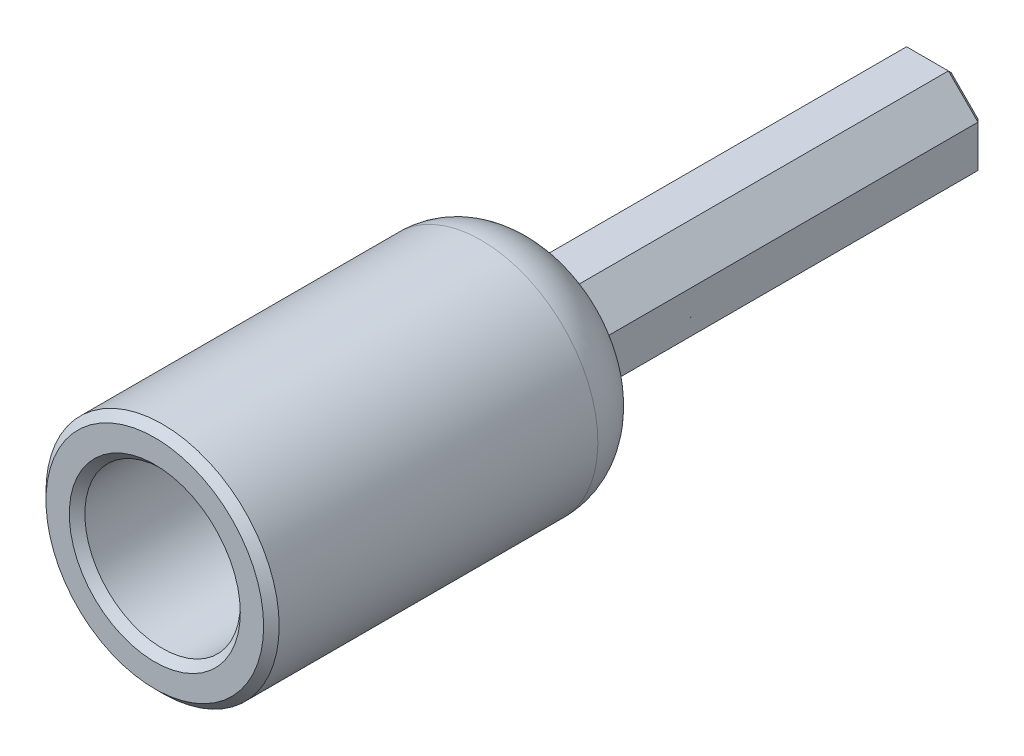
ISO-10303-21;
HEADER;
FILE_DESCRIPTION(('STEP AP214'),'2;1');
FILE_NAME('part.step','',(''),(''),'','','');
FILE_SCHEMA(('AUTOMOTIVE_DESIGN { 1 0 10303 214 1 1 1 1 }'));
ENDSEC;
DATA;
#1=APPLICATION_CONTEXT('core data for automotive mechanical design processes');
#2=APPLICATION_PROTOCOL_DEFINITION('international standard','automotive_design',2000,#1);
#3=PRODUCT_CONTEXT('',#1,'mechanical');
#4=PRODUCT('Part','Part','',(#3));
#5=PRODUCT_RELATED_PRODUCT_CATEGORY('part','',(#4));
#6=PRODUCT_DEFINITION_FORMATION('','',#4);
#7=PRODUCT_DEFINITION_CONTEXT('part definition',#1,'design');
#8=PRODUCT_DEFINITION('design','',#6,#7);
#9=PRODUCT_DEFINITION_SHAPE('','',#8);
#10=(LENGTH_UNIT() NAMED_UNIT(*) SI_UNIT(.MILLI.,.METRE.));
#11=(NAMED_UNIT(*) PLANE_ANGLE_UNIT() SI_UNIT($,.RADIAN.));
#12=(NAMED_UNIT(*) SI_UNIT($,.STERADIAN.) SOLID_ANGLE_UNIT());
#13=UNCERTAINTY_MEASURE_WITH_UNIT(LENGTH_MEASURE(1.E-05),#10,'distance_accuracy_value','');
#14=(GEOMETRIC_REPRESENTATION_CONTEXT(3) GLOBAL_UNCERTAINTY_ASSIGNED_CONTEXT((#13)) GLOBAL_UNIT_ASSIGNED_CONTEXT((#10,
#11,#12)) REPRESENTATION_CONTEXT('',''));
#15=CARTESIAN_POINT('',(0.,0.,0.));
#16=DIRECTION('',(0.,0.,1.));
#17=DIRECTION('',(1.,0.,0.));
#18=AXIS2_PLACEMENT_3D('',#15,#16,#17);
#19=CARTESIAN_POINT('',(0.,0.,0.));
#20=DIRECTION('',(0.,0.,1.));
#21=DIRECTION('',(1.,0.,0.));
#22=AXIS2_PLACEMENT_3D('',#19,#20,#21);
#23=PLANE('',#22);
#24=DIRECTION('',(1.,0.,0.));
#25=VECTOR('',#24,1.);
#26=CARTESIAN_POINT('',(-1.34619407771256,3.25,0.));
#27=LINE('',#26,#25);
#28=CARTESIAN_POINT('',(-1.29903810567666,3.25,0.));
#29=VERTEX_POINT('',#28);
#30=CARTESIAN_POINT('',(1.29903810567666,3.25,0.));
#31=VERTEX_POINT('',#30);
#32=EDGE_CURVE('E351',#29,#31,#27,.T.);
#33=ORIENTED_EDGE('',*,*,#32,.F.);
#34=CARTESIAN_POINT('',(0.,0.,0.));
#35=DIRECTION('',(0.,0.,1.));
#36=DIRECTION('',(1.,0.,0.));
#37=AXIS2_PLACEMENT_3D('',#34,#35,#36);
#38=CIRCLE('',#37,3.5);
#39=EDGE_CURVE('E226',#29,#31,#38,.F.);
#40=ORIENTED_EDGE('',*,*,#39,.T.);
#41=EDGE_LOOP('',(#33,#40));
#42=FACE_BOUND('',#41,.T.);
#43=ADVANCED_FACE('F33',(#42),#23,.F.);
#44=DIRECTION('',(0.707106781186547,-0.707106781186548,0.));
#45=VECTOR('',#44,1.);
#46=CARTESIAN_POINT('',(1.34619407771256,3.25,0.));
#47=LINE('',#46,#45);
#48=CARTESIAN_POINT('',(1.37953838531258,3.21665569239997,0.));
#49=VERTEX_POINT('',#48);
#50=CARTESIAN_POINT('',(3.21665569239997,1.37953838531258,0.));
#51=VERTEX_POINT('',#50);
#52=EDGE_CURVE('E344',#49,#51,#47,.T.);
#53=ORIENTED_EDGE('',*,*,#52,.F.);
#54=CARTESIAN_POINT('',(0.,0.,0.));
#55=DIRECTION('',(0.,0.,1.));
#56=DIRECTION('',(1.,0.,0.));
#57=AXIS2_PLACEMENT_3D('',#54,#55,#56);
#58=CIRCLE('',#57,3.5);
#59=EDGE_CURVE('E224',#49,#51,#58,.F.);
#60=ORIENTED_EDGE('',*,*,#59,.T.);
#61=EDGE_LOOP('',(#53,#60));
#62=FACE_BOUND('',#61,.T.);
#63=ADVANCED_FACE('F349',(#62),#23,.F.);
#64=DIRECTION('',(0.,-1.,0.));
#65=VECTOR('',#64,1.);
#66=CARTESIAN_POINT('',(3.25,1.34619407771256,0.));
#67=LINE('',#66,#65);
#68=CARTESIAN_POINT('',(3.25,1.29903810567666,0.));
#69=VERTEX_POINT('',#68);
#70=CARTESIAN_POINT('',(3.25,-1.29903810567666,0.));
#71=VERTEX_POINT('',#70);
#72=EDGE_CURVE('E350',#69,#71,#67,.T.);
#73=ORIENTED_EDGE('',*,*,#72,.F.);
#74=CARTESIAN_POINT('',(0.,0.,0.));
#75=DIRECTION('',(0.,0.,1.));
#76=DIRECTION('',(1.,0.,0.));
#77=AXIS2_PLACEMENT_3D('',#74,#75,#76);
#78=CIRCLE('',#77,3.5);
#79=EDGE_CURVE('E217',#69,#71,#78,.F.);
#80=ORIENTED_EDGE('',*,*,#79,.T.);
#81=EDGE_LOOP('',(#73,#80));
#82=FACE_BOUND('',#81,.T.);
#83=ADVANCED_FACE('F361',(#82),#23,.F.);
#84=DIRECTION('',(-0.707106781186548,-0.707106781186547,0.));
#85=VECTOR('',#84,1.);
#86=CARTESIAN_POINT('',(3.25,-1.34619407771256,0.));
#87=LINE('',#86,#85);
#88=CARTESIAN_POINT('',(3.21665569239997,-1.37953838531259,0.));
#89=VERTEX_POINT('',#88);
#90=CARTESIAN_POINT('',(1.37953838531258,-3.21665569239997,0.));
#91=VERTEX_POINT('',#90);
#92=EDGE_CURVE('E362',#89,#91,#87,.T.);
#93=ORIENTED_EDGE('',*,*,#92,.F.);
#94=CARTESIAN_POINT('',(0.,0.,0.));
#95=DIRECTION('',(0.,0.,1.));
#96=DIRECTION('',(1.,0.,0.));
#97=AXIS2_PLACEMENT_3D('',#94,#95,#96);
#98=CIRCLE('',#97,3.5);
#99=EDGE_CURVE('E213',#89,#91,#98,.F.);
#100=ORIENTED_EDGE('',*,*,#99,.T.);
#101=EDGE_LOOP('',(#93,#100));
#102=FACE_BOUND('',#101,.T.);
#103=ADVANCED_FACE('F504',(#102),#23,.F.);
#104=DIRECTION('',(-0.707106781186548,0.707106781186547,0.));
#105=VECTOR('',#104,1.);
#106=CARTESIAN_POINT('',(-1.34619407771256,-3.25,0.));
#107=LINE('',#106,#105);
#108=CARTESIAN_POINT('',(-1.37953838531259,-3.21665569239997,0.));
#109=VERTEX_POINT('',#108);
#110=CARTESIAN_POINT('',(-3.21665569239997,-1.37953838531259,0.));
#111=VERTEX_POINT('',#110);
#112=EDGE_CURVE('E200',#109,#111,#107,.T.);
#113=ORIENTED_EDGE('',*,*,#112,.F.);
#114=CARTESIAN_POINT('',(0.,0.,0.));
#115=DIRECTION('',(0.,0.,1.));
#116=DIRECTION('',(1.,0.,0.));
#117=AXIS2_PLACEMENT_3D('',#114,#115,#116);
#118=CIRCLE('',#117,3.5);
#119=EDGE_CURVE('E207',#109,#111,#118,.F.);
#120=ORIENTED_EDGE('',*,*,#119,.T.);
#121=EDGE_LOOP('',(#113,#120));
#122=FACE_BOUND('',#121,.T.);
#123=ADVANCED_FACE('F206',(#122),#23,.F.);
#124=DIRECTION('',(0.,1.,0.));
#125=VECTOR('',#124,1.);
#126=CARTESIAN_POINT('',(-3.25,-1.34619407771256,0.));
#127=LINE('',#126,#125);
#128=CARTESIAN_POINT('',(-3.25,-1.29903810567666,0.));
#129=VERTEX_POINT('',#128);
#130=CARTESIAN_POINT('',(-3.25,1.29903810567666,0.));
#131=VERTEX_POINT('',#130);
#132=EDGE_CURVE('E208',#129,#131,#127,.T.);
#133=ORIENTED_EDGE('',*,*,#132,.F.);
#134=CARTESIAN_POINT('',(0.,0.,0.));
#135=DIRECTION('',(0.,0.,1.));
#136=DIRECTION('',(1.,0.,0.));
#137=AXIS2_PLACEMENT_3D('',#134,#135,#136);
#138=CIRCLE('',#137,3.5);
#139=EDGE_CURVE('E214',#129,#131,#138,.F.);
#140=ORIENTED_EDGE('',*,*,#139,.T.);
#141=EDGE_LOOP('',(#133,#140));
#142=FACE_BOUND('',#141,.T.);
#143=ADVANCED_FACE('F511',(#142),#23,.F.);
#144=CARTESIAN_POINT('',(0.,0.,25.));
#145=DIRECTION('',(0.,0.,-1.));
#146=DIRECTION('',(-1.,0.,0.));
#147=AXIS2_PLACEMENT_3D('',#144,#145,#146);
#148=CYLINDRICAL_SURFACE('',#147,2.5);
#149=CARTESIAN_POINT('',(0.,0.,-25.));
#150=DIRECTION('',(0.,0.,-1.));
#151=DIRECTION('',(-1.,0.,0.));
#152=AXIS2_PLACEMENT_3D('',#149,#150,#151);
#153=CIRCLE('',#152,2.5);
#154=CARTESIAN_POINT('',(-2.5,0.,-25.));
#155=VERTEX_POINT('',#154);
#156=EDGE_CURVE('E387',#155,#155,#153,.T.);
#157=ORIENTED_EDGE('',*,*,#156,.T.);
#158=EDGE_LOOP('',(#157));
#159=FACE_BOUND('',#158,.T.);
#160=CARTESIAN_POINT('',(0.,0.,13.));
#161=DIRECTION('',(0.,0.,1.));
#162=DIRECTION('',(1.,0.,0.));
#163=AXIS2_PLACEMENT_3D('',#160,#161,#162);
#164=CIRCLE('',#163,2.5);
#165=CARTESIAN_POINT('',(2.5,0.,13.));
#166=VERTEX_POINT('',#165);
#167=EDGE_CURVE('E384',#166,#166,#164,.F.);
#168=ORIENTED_EDGE('',*,*,#167,.F.);
#169=EDGE_LOOP('',(#168));
#170=FACE_BOUND('',#169,.T.);
#171=ADVANCED_FACE('F519',(#159,#170),#148,.F.);
#172=DIRECTION('',(0.707106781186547,0.707106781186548,0.));
#173=VECTOR('',#172,1.);
#174=CARTESIAN_POINT('',(-3.25,1.34619407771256,0.));
#175=LINE('',#174,#173);
#176=CARTESIAN_POINT('',(-3.21665569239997,1.37953838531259,0.));
#177=VERTEX_POINT('',#176);
#178=CARTESIAN_POINT('',(-1.37953838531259,3.21665569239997,0.));
#179=VERTEX_POINT('',#178);
#180=EDGE_CURVE('E461',#177,#179,#175,.T.);
#181=ORIENTED_EDGE('',*,*,#180,.F.);
#182=CARTESIAN_POINT('',(0.,0.,0.));
#183=DIRECTION('',(0.,0.,1.));
#184=DIRECTION('',(1.,0.,0.));
#185=AXIS2_PLACEMENT_3D('',#182,#183,#184);
#186=CIRCLE('',#185,3.5);
#187=EDGE_CURVE('E219',#177,#179,#186,.F.);
#188=ORIENTED_EDGE('',*,*,#187,.T.);
#189=EDGE_LOOP('',(#181,#188));
#190=FACE_BOUND('',#189,.T.);
#191=ADVANCED_FACE('F460',(#190),#23,.F.);
#192=CARTESIAN_POINT('',(0.,0.,25.));
#193=DIRECTION('',(0.,0.,-1.));
#194=DIRECTION('',(-1.,0.,0.));
#195=AXIS2_PLACEMENT_3D('',#192,#193,#194);
#196=CYLINDRICAL_SURFACE('',#195,7.5);
#197=CARTESIAN_POINT('',(0.,0.,4.));
#198=DIRECTION('',(0.,0.,1.));
#199=DIRECTION('',(1.,0.,0.));
#200=AXIS2_PLACEMENT_3D('',#197,#198,#199);
#201=CIRCLE('',#200,7.5);
#202=CARTESIAN_POINT('',(2.09601180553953,-7.20116202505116,4.));
#203=VERTEX_POINT('',#202);
#204=CARTESIAN_POINT('',(-2.09601180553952,-7.20116202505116,4.));
#205=VERTEX_POINT('',#204);
#206=EDGE_CURVE('E433',#203,#205,#201,.T.);
#207=ORIENTED_EDGE('',*,*,#206,.T.);
#208=CARTESIAN_POINT('',(0.,0.,-3.22916358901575));
#209=DIRECTION('',(0.,0.708477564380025,0.705733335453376));
#210=DIRECTION('',(0.,0.705733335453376,-0.708477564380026));
#211=AXIS2_PLACEMENT_3D('',#208,#209,#210);
#212=ELLIPSE('',#211,10.627243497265,7.5);
#213=EDGE_CURVE('E180',#205,#203,#212,.T.);
#214=ORIENTED_EDGE('',*,*,#213,.T.);
#215=EDGE_LOOP('',(#207,#214));
#216=FACE_BOUND('',#215,.T.);
#217=CARTESIAN_POINT('',(0.,0.,24.5));
#218=DIRECTION('',(0.,0.,1.));
#219=DIRECTION('',(1.,0.,0.));
#220=AXIS2_PLACEMENT_3D('',#217,#218,#219);
#221=CIRCLE('',#220,7.5);
#222=CARTESIAN_POINT('',(7.5,0.,24.5));
#223=VERTEX_POINT('',#222);
#224=EDGE_CURVE('E397',#223,#223,#221,.F.);
#225=ORIENTED_EDGE('',*,*,#224,.T.);
#226=EDGE_LOOP('',(#225));
#227=FACE_BOUND('',#226,.T.);
#228=ADVANCED_FACE('F518',(#216,#227),#196,.T.);
#229=CARTESIAN_POINT('',(0.,0.,25.));
#230=DIRECTION('',(0.,0.,1.));
#231=DIRECTION('',(1.,0.,0.));
#232=AXIS2_PLACEMENT_3D('',#229,#230,#231);
#233=PLANE('',#232);
#234=CARTESIAN_POINT('',(0.,0.,25.));
#235=DIRECTION('',(0.,0.,1.));
#236=DIRECTION('',(1.,0.,0.));
#237=AXIS2_PLACEMENT_3D('',#234,#235,#236);
#238=CIRCLE('',#237,5.50000000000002);
#239=CARTESIAN_POINT('',(5.50000000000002,0.,25.));
#240=VERTEX_POINT('',#239);
#241=EDGE_CURVE('E394',#240,#240,#238,.F.);
#242=ORIENTED_EDGE('',*,*,#241,.T.);
#243=EDGE_LOOP('',(#242));
#244=FACE_BOUND('',#243,.T.);
#245=CARTESIAN_POINT('',(0.,0.,25.));
#246=DIRECTION('',(0.,0.,1.));
#247=DIRECTION('',(1.,0.,0.));
#248=AXIS2_PLACEMENT_3D('',#245,#246,#247);
#249=CIRCLE('',#248,7.);
#250=CARTESIAN_POINT('',(7.,0.,25.));
#251=VERTEX_POINT('',#250);
#252=EDGE_CURVE('E391',#251,#251,#249,.T.);
#253=ORIENTED_EDGE('',*,*,#252,.T.);
#254=EDGE_LOOP('',(#253));
#255=FACE_BOUND('',#254,.T.);
#256=ADVANCED_FACE('F524',(#244,#255),#233,.T.);
#257=CARTESIAN_POINT('',(-3.25,1.34619407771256,-25.));
#258=DIRECTION('',(0.707106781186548,-0.707106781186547,0.));
#259=DIRECTION('',(0.707106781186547,0.707106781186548,0.));
#260=AXIS2_PLACEMENT_3D('',#257,#258,#259);
#261=PLANE('',#260);
#262=DIRECTION('',(0.,0.,1.));
#263=VECTOR('',#262,1.);
#264=CARTESIAN_POINT('',(-1.34619407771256,3.25,-25.));
#265=LINE('',#264,#263);
#266=CARTESIAN_POINT('',(-1.34619407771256,3.25,-24.7));
#267=VERTEX_POINT('',#266);
#268=CARTESIAN_POINT('',(-1.34619407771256,3.25,3.94924720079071E-05));
#269=VERTEX_POINT('',#268);
#270=EDGE_CURVE('E54',#267,#269,#265,.T.);
#271=ORIENTED_EDGE('',*,*,#270,.F.);
#272=DIRECTION('',(-0.707106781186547,-0.707106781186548,0.));
#273=VECTOR('',#272,1.);
#274=CARTESIAN_POINT('',(-3.25,1.34619407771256,-24.7));
#275=LINE('',#274,#273);
#276=CARTESIAN_POINT('',(-3.25,1.34619407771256,-24.7));
#277=VERTEX_POINT('',#276);
#278=EDGE_CURVE('E417',#267,#277,#275,.T.);
#279=ORIENTED_EDGE('',*,*,#278,.T.);
#280=DIRECTION('',(0.,0.,1.));
#281=VECTOR('',#280,1.);
#282=CARTESIAN_POINT('',(-3.25,1.34619407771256,-25.));
#283=LINE('',#282,#281);
#284=CARTESIAN_POINT('',(-3.25,1.34619407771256,3.94924720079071E-05));
#285=VERTEX_POINT('',#284);
#286=EDGE_CURVE('E62',#277,#285,#283,.T.);
#287=ORIENTED_EDGE('',*,*,#286,.T.);
#288=CARTESIAN_POINT('',(-3.25,1.34619407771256,3.94924720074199E-05));
#289=CARTESIAN_POINT('',(-3.24444261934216,1.3517514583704,2.62280129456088E-05));
#290=CARTESIAN_POINT('',(-3.23888523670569,1.35730884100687,1.6304744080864E-05));
#291=CARTESIAN_POINT('',(-3.22777046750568,1.36842361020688,3.14058678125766E-06));
#292=CARTESIAN_POINT('',(-3.22221308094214,1.37398099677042,-1.00301689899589E-07));
#293=CARTESIAN_POINT('',(-3.21665569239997,1.37953838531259,0.));
#294=B_SPLINE_CURVE_WITH_KNOTS('',3,(#288,#289,#290,#291,#292,#293),.UNSPECIFIED.,.F.,.F.,(4,2,
4),(0.,0.0235779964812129,0.0471559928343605),.UNSPECIFIED.);
#295=EDGE_CURVE('E267',#285,#177,#294,.T.);
#296=ORIENTED_EDGE('',*,*,#295,.T.);
#297=ORIENTED_EDGE('',*,*,#180,.T.);
#298=CARTESIAN_POINT('',(-1.37953838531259,3.21665569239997,0.));
#299=CARTESIAN_POINT('',(-1.37398099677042,3.22221308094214,-1.00301689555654E-07));
#300=CARTESIAN_POINT('',(-1.36842361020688,3.22777046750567,3.14058678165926E-06));
#301=CARTESIAN_POINT('',(-1.35730884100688,3.23888523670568,1.63047440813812E-05));
#302=CARTESIAN_POINT('',(-1.3517514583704,3.24444261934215,2.62280129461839E-05));
#303=CARTESIAN_POINT('',(-1.34619407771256,3.25,3.9492472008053E-05));
#304=B_SPLINE_CURVE_WITH_KNOTS('',3,(#298,#299,#300,#301,#302,#303),.UNSPECIFIED.,.F.,.F.,(4,2,
4),(0.,0.0235779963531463,0.0471559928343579),.UNSPECIFIED.);
#305=EDGE_CURVE('E261',#179,#269,#304,.T.);
#306=ORIENTED_EDGE('',*,*,#305,.T.);
#307=EDGE_LOOP('',(#271,#279,#287,#296,#297,#306));
#308=FACE_BOUND('',#307,.T.);
#309=ADVANCED_FACE('F249',(#308),#261,.F.);
#310=CARTESIAN_POINT('',(-1.34619407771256,3.25,-25.));
#311=DIRECTION('',(0.,-1.,0.));
#312=DIRECTION('',(1.,0.,0.));
#313=AXIS2_PLACEMENT_3D('',#310,#311,#312);
#314=PLANE('',#313);
#315=DIRECTION('',(0.,0.,1.));
#316=VECTOR('',#315,1.);
#317=CARTESIAN_POINT('',(1.34619407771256,3.25,-25.));
#318=LINE('',#317,#316);
#319=CARTESIAN_POINT('',(1.34619407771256,3.25,-24.7));
#320=VERTEX_POINT('',#319);
#321=CARTESIAN_POINT('',(1.34619407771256,3.25,3.94924720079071E-05));
#322=VERTEX_POINT('',#321);
#323=EDGE_CURVE('E346',#320,#322,#318,.T.);
#324=ORIENTED_EDGE('',*,*,#323,.F.);
#325=DIRECTION('',(-1.,0.,0.));
#326=VECTOR('',#325,1.);
#327=CARTESIAN_POINT('',(-1.34619407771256,3.25,-24.7));
#328=LINE('',#327,#326);
#329=EDGE_CURVE('E431',#320,#267,#328,.T.);
#330=ORIENTED_EDGE('',*,*,#329,.T.);
#331=ORIENTED_EDGE('',*,*,#270,.T.);
#332=CARTESIAN_POINT('',(-1.34619407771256,3.25,3.94924720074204E-05));
#333=CARTESIAN_POINT('',(-1.33833475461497,3.25,2.62280129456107E-05));
#334=CARTESIAN_POINT('',(-1.33047542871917,3.25,1.63047440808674E-05));
#335=CARTESIAN_POINT('',(-1.31475677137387,3.25,3.14058678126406E-06));
#336=CARTESIAN_POINT('',(-1.30689743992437,3.25,-1.003016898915E-07));
#337=CARTESIAN_POINT('',(-1.29903810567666,3.25,0.));
#338=B_SPLINE_CURVE_WITH_KNOTS('',3,(#332,#333,#334,#335,#336,#337),.UNSPECIFIED.,.F.,.F.,(4,2,
4),(0.,0.0235779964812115,0.0471559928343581),.UNSPECIFIED.);
#339=EDGE_CURVE('E255',#269,#29,#338,.T.);
#340=ORIENTED_EDGE('',*,*,#339,.T.);
#341=ORIENTED_EDGE('',*,*,#32,.T.);
#342=CARTESIAN_POINT('',(1.29903810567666,3.25,0.));
#343=CARTESIAN_POINT('',(1.30689743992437,3.25,-1.00301689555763E-07));
#344=CARTESIAN_POINT('',(1.31475677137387,3.25,3.14058678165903E-06));
#345=CARTESIAN_POINT('',(1.33047542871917,3.25,1.63047440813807E-05));
#346=CARTESIAN_POINT('',(1.33833475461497,3.25,2.62280129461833E-05));
#347=CARTESIAN_POINT('',(1.34619407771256,3.25,3.94924720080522E-05));
#348=B_SPLINE_CURVE_WITH_KNOTS('',3,(#342,#343,#344,#345,#346,#347),.UNSPECIFIED.,.F.,.F.,(4,2,
4),(0.,0.0235779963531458,0.0471559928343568),.UNSPECIFIED.);
#349=EDGE_CURVE('E229',#31,#322,#348,.T.);
#350=ORIENTED_EDGE('',*,*,#349,.T.);
#351=EDGE_LOOP('',(#324,#330,#331,#340,#341,#350));
#352=FACE_BOUND('',#351,.T.);
#353=ADVANCED_FACE('F244',(#352),#314,.F.);
#354=CARTESIAN_POINT('',(1.34619407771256,3.25,-25.));
#355=DIRECTION('',(-0.707106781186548,-0.707106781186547,0.));
#356=DIRECTION('',(0.707106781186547,-0.707106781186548,0.));
#357=AXIS2_PLACEMENT_3D('',#354,#355,#356);
#358=PLANE('',#357);
#359=DIRECTION('',(0.,0.,1.));
#360=VECTOR('',#359,1.);
#361=CARTESIAN_POINT('',(3.25,1.34619407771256,-25.));
#362=LINE('',#361,#360);
#363=CARTESIAN_POINT('',(3.25,1.34619407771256,-24.7));
#364=VERTEX_POINT('',#363);
#365=CARTESIAN_POINT('',(3.25,1.34619407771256,3.94924720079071E-05));
#366=VERTEX_POINT('',#365);
#367=EDGE_CURVE('E359',#364,#366,#362,.T.);
#368=ORIENTED_EDGE('',*,*,#367,.F.);
#369=DIRECTION('',(-0.707106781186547,0.707106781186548,0.));
#370=VECTOR('',#369,1.);
#371=CARTESIAN_POINT('',(1.34619407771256,3.25,-24.7));
#372=LINE('',#371,#370);
#373=EDGE_CURVE('E429',#364,#320,#372,.T.);
#374=ORIENTED_EDGE('',*,*,#373,.T.);
#375=ORIENTED_EDGE('',*,*,#323,.T.);
#376=CARTESIAN_POINT('',(1.34619407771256,3.25,3.94924720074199E-05));
#377=CARTESIAN_POINT('',(1.3517514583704,3.24444261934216,2.62280129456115E-05));
#378=CARTESIAN_POINT('',(1.35730884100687,3.23888523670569,1.63047440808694E-05));
#379=CARTESIAN_POINT('',(1.36842361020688,3.22777046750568,3.14058678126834E-06));
#380=CARTESIAN_POINT('',(1.37398099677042,3.22221308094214,-1.00301689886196E-07));
#381=CARTESIAN_POINT('',(1.37953838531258,3.21665569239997,0.));
#382=B_SPLINE_CURVE_WITH_KNOTS('',3,(#376,#377,#378,#379,#380,#381),.UNSPECIFIED.,.F.,.F.,(4,2,
4),(0.,0.0235779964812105,0.0471559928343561),.UNSPECIFIED.);
#383=EDGE_CURVE('E237',#322,#49,#382,.T.);
#384=ORIENTED_EDGE('',*,*,#383,.T.);
#385=ORIENTED_EDGE('',*,*,#52,.T.);
#386=CARTESIAN_POINT('',(3.21665569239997,1.37953838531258,0.));
#387=CARTESIAN_POINT('',(3.22221308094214,1.37398099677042,-1.00301689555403E-07));
#388=CARTESIAN_POINT('',(3.22777046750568,1.36842361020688,3.14058678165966E-06));
#389=CARTESIAN_POINT('',(3.23888523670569,1.35730884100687,1.63047440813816E-05));
#390=CARTESIAN_POINT('',(3.24444261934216,1.3517514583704,2.62280129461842E-05));
#391=CARTESIAN_POINT('',(3.25,1.34619407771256,3.94924720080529E-05));
#392=B_SPLINE_CURVE_WITH_KNOTS('',3,(#386,#387,#388,#389,#390,#391),.UNSPECIFIED.,.F.,.F.,(4,2,
4),(0.,0.0235779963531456,0.0471559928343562),.UNSPECIFIED.);
#393=EDGE_CURVE('E331',#51,#366,#392,.T.);
#394=ORIENTED_EDGE('',*,*,#393,.T.);
#395=EDGE_LOOP('',(#368,#374,#375,#384,#385,#394));
#396=FACE_BOUND('',#395,.T.);
#397=ADVANCED_FACE('F248',(#396),#358,.F.);
#398=CARTESIAN_POINT('',(3.25,1.34619407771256,-25.));
#399=DIRECTION('',(-1.,0.,0.));
#400=DIRECTION('',(0.,-1.,0.));
#401=AXIS2_PLACEMENT_3D('',#398,#399,#400);
#402=PLANE('',#401);
#403=DIRECTION('',(0.,0.,1.));
#404=VECTOR('',#403,1.);
#405=CARTESIAN_POINT('',(3.25,-1.34619407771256,-25.));
#406=LINE('',#405,#404);
#407=CARTESIAN_POINT('',(3.25,-1.34619407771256,-24.7));
#408=VERTEX_POINT('',#407);
#409=CARTESIAN_POINT('',(3.25,-1.34619407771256,3.94924720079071E-05));
#410=VERTEX_POINT('',#409);
#411=EDGE_CURVE('E378',#408,#410,#406,.T.);
#412=ORIENTED_EDGE('',*,*,#411,.F.);
#413=DIRECTION('',(0.,1.,0.));
#414=VECTOR('',#413,1.);
#415=CARTESIAN_POINT('',(3.25,1.34619407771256,-24.7));
#416=LINE('',#415,#414);
#417=EDGE_CURVE('E427',#408,#364,#416,.T.);
#418=ORIENTED_EDGE('',*,*,#417,.T.);
#419=ORIENTED_EDGE('',*,*,#367,.T.);
#420=CARTESIAN_POINT('',(3.25,1.34619407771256,3.94924720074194E-05));
#421=CARTESIAN_POINT('',(3.25,1.33833475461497,2.62280129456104E-05));
#422=CARTESIAN_POINT('',(3.25,1.33047542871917,1.63047440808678E-05));
#423=CARTESIAN_POINT('',(3.25,1.31475677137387,3.14058678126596E-06));
#424=CARTESIAN_POINT('',(3.25,1.30689743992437,-1.00301689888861E-07));
#425=CARTESIAN_POINT('',(3.25,1.29903810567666,0.));
#426=B_SPLINE_CURVE_WITH_KNOTS('',3,(#420,#421,#422,#423,#424,#425),.UNSPECIFIED.,.F.,.F.,(4,2,
4),(0.,0.0235779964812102,0.0471559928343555),.UNSPECIFIED.);
#427=EDGE_CURVE('E326',#366,#69,#426,.T.);
#428=ORIENTED_EDGE('',*,*,#427,.T.);
#429=ORIENTED_EDGE('',*,*,#72,.T.);
#430=CARTESIAN_POINT('',(3.25,-1.29903810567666,0.));
#431=CARTESIAN_POINT('',(3.25,-1.30689743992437,-1.00301689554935E-07));
#432=CARTESIAN_POINT('',(3.25,-1.31475677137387,3.14058678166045E-06));
#433=CARTESIAN_POINT('',(3.25,-1.33047542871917,1.63047440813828E-05));
#434=CARTESIAN_POINT('',(3.25,-1.33833475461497,2.62280129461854E-05));
#435=CARTESIAN_POINT('',(3.25,-1.34619407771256,3.9492472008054E-05));
#436=B_SPLINE_CURVE_WITH_KNOTS('',3,(#430,#431,#432,#433,#434,#435),.UNSPECIFIED.,.F.,.F.,(4,2,
4),(0.,0.0235779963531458,0.0471559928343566),.UNSPECIFIED.);
#437=EDGE_CURVE('E311',#71,#410,#436,.T.);
#438=ORIENTED_EDGE('',*,*,#437,.T.);
#439=EDGE_LOOP('',(#412,#418,#419,#428,#429,#438));
#440=FACE_BOUND('',#439,.T.);
#441=ADVANCED_FACE('F320',(#440),#402,.F.);
#442=CARTESIAN_POINT('',(3.25,-1.34619407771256,-25.));
#443=DIRECTION('',(-0.707106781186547,0.707106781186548,0.));
#444=DIRECTION('',(-0.707106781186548,-0.707106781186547,0.));
#445=AXIS2_PLACEMENT_3D('',#442,#443,#444);
#446=PLANE('',#445);
#447=ORIENTED_EDGE('',*,*,#92,.T.);
#448=DIRECTION('',(-0.707106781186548,-0.707106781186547,0.));
#449=VECTOR('',#448,1.);
#450=CARTESIAN_POINT('',(3.25,-1.34619407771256,0.));
#451=LINE('',#450,#449);
#452=CARTESIAN_POINT('',(1.34619407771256,-3.25,0.));
#453=VERTEX_POINT('',#452);
#454=EDGE_CURVE('E192',#91,#453,#451,.T.);
#455=ORIENTED_EDGE('',*,*,#454,.T.);
#456=DIRECTION('',(0.,0.,1.));
#457=VECTOR('',#456,1.);
#458=CARTESIAN_POINT('',(1.34619407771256,-3.25,-25.));
#459=LINE('',#458,#457);
#460=CARTESIAN_POINT('',(1.34619407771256,-3.25,-24.7));
#461=VERTEX_POINT('',#460);
#462=EDGE_CURVE('E375',#461,#453,#459,.T.);
#463=ORIENTED_EDGE('',*,*,#462,.F.);
#464=DIRECTION('',(0.707106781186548,0.707106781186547,0.));
#465=VECTOR('',#464,1.);
#466=CARTESIAN_POINT('',(3.25,-1.34619407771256,-24.7));
#467=LINE('',#466,#465);
#468=EDGE_CURVE('E425',#461,#408,#467,.T.);
#469=ORIENTED_EDGE('',*,*,#468,.T.);
#470=ORIENTED_EDGE('',*,*,#411,.T.);
#471=CARTESIAN_POINT('',(3.25,-1.34619407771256,3.94924720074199E-05));
#472=CARTESIAN_POINT('',(3.24444261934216,-1.3517514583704,2.62280129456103E-05));
#473=CARTESIAN_POINT('',(3.23888523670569,-1.35730884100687,1.63047440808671E-05));
#474=CARTESIAN_POINT('',(3.22777046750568,-1.36842361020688,3.14058678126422E-06));
#475=CARTESIAN_POINT('',(3.22221308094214,-1.37398099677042,-1.00301689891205E-07));
#476=CARTESIAN_POINT('',(3.21665569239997,-1.37953838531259,0.));
#477=B_SPLINE_CURVE_WITH_KNOTS('',3,(#471,#472,#473,#474,#475,#476),.UNSPECIFIED.,.F.,.F.,(4,2,
4),(0.,0.0235779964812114,0.0471559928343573),.UNSPECIFIED.);
#478=EDGE_CURVE('E305',#410,#89,#477,.T.);
#479=ORIENTED_EDGE('',*,*,#478,.T.);
#480=EDGE_LOOP('',(#447,#455,#463,#469,#470,#479));
#481=FACE_BOUND('',#480,.T.);
#482=ADVANCED_FACE('F317',(#481),#446,.F.);
#483=CARTESIAN_POINT('',(1.34619407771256,-3.25,-25.));
#484=DIRECTION('',(0.,1.,0.));
#485=DIRECTION('',(-1.,0.,0.));
#486=AXIS2_PLACEMENT_3D('',#483,#484,#485);
#487=PLANE('',#486);
#488=ORIENTED_EDGE('',*,*,#462,.T.);
#489=DIRECTION('',(-1.,0.,0.));
#490=VECTOR('',#489,1.);
#491=CARTESIAN_POINT('',(1.34619407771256,-3.25,0.));
#492=LINE('',#491,#490);
#493=CARTESIAN_POINT('',(-1.34619407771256,-3.25,0.));
#494=VERTEX_POINT('',#493);
#495=EDGE_CURVE('E209',#453,#494,#492,.T.);
#496=ORIENTED_EDGE('',*,*,#495,.T.);
#497=DIRECTION('',(0.,0.,1.));
#498=VECTOR('',#497,1.);
#499=CARTESIAN_POINT('',(-1.34619407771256,-3.25,-25.));
#500=LINE('',#499,#498);
#501=CARTESIAN_POINT('',(-1.34619407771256,-3.25,-24.7));
#502=VERTEX_POINT('',#501);
#503=EDGE_CURVE('E203',#502,#494,#500,.T.);
#504=ORIENTED_EDGE('',*,*,#503,.F.);
#505=DIRECTION('',(1.,0.,0.));
#506=VECTOR('',#505,1.);
#507=CARTESIAN_POINT('',(1.34619407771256,-3.25,-24.7));
#508=LINE('',#507,#506);
#509=EDGE_CURVE('E423',#502,#461,#508,.T.);
#510=ORIENTED_EDGE('',*,*,#509,.T.);
#511=EDGE_LOOP('',(#488,#496,#504,#510));
#512=FACE_BOUND('',#511,.T.);
#513=ADVANCED_FACE('F298',(#512),#487,.F.);
#514=CARTESIAN_POINT('',(-1.34619407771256,-3.25,-25.));
#515=DIRECTION('',(0.707106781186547,0.707106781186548,0.));
#516=DIRECTION('',(-0.707106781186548,0.707106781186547,0.));
#517=AXIS2_PLACEMENT_3D('',#514,#515,#516);
#518=PLANE('',#517);
#519=ORIENTED_EDGE('',*,*,#503,.T.);
#520=DIRECTION('',(-0.707106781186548,0.707106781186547,0.));
#521=VECTOR('',#520,1.);
#522=CARTESIAN_POINT('',(-1.34619407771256,-3.25,0.));
#523=LINE('',#522,#521);
#524=EDGE_CURVE('E189',#494,#109,#523,.T.);
#525=ORIENTED_EDGE('',*,*,#524,.T.);
#526=ORIENTED_EDGE('',*,*,#112,.T.);
#527=CARTESIAN_POINT('',(-3.21665569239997,-1.37953838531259,0.));
#528=CARTESIAN_POINT('',(-3.22221308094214,-1.37398099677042,-1.00301689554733E-07));
#529=CARTESIAN_POINT('',(-3.22777046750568,-1.36842361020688,3.14058678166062E-06));
#530=CARTESIAN_POINT('',(-3.23888523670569,-1.35730884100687,1.63047440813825E-05));
#531=CARTESIAN_POINT('',(-3.24444261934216,-1.3517514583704,2.62280129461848E-05));
#532=CARTESIAN_POINT('',(-3.25,-1.34619407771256,3.94924720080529E-05));
#533=B_SPLINE_CURVE_WITH_KNOTS('',3,(#527,#528,#529,#530,#531,#532),.UNSPECIFIED.,.F.,.F.,(4,2,
4),(0.,0.0235779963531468,0.047155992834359),.UNSPECIFIED.);
#534=CARTESIAN_POINT('',(-3.25,-1.34619407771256,3.94924720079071E-05));
#535=VERTEX_POINT('',#534);
#536=EDGE_CURVE('E212',#111,#535,#533,.T.);
#537=ORIENTED_EDGE('',*,*,#536,.T.);
#538=DIRECTION('',(0.,0.,1.));
#539=VECTOR('',#538,1.);
#540=CARTESIAN_POINT('',(-3.25,-1.34619407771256,-25.));
#541=LINE('',#540,#539);
#542=CARTESIAN_POINT('',(-3.25,-1.34619407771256,-24.7));
#543=VERTEX_POINT('',#542);
#544=EDGE_CURVE('E372',#543,#535,#541,.T.);
#545=ORIENTED_EDGE('',*,*,#544,.F.);
#546=DIRECTION('',(0.707106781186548,-0.707106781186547,0.));
#547=VECTOR('',#546,1.);
#548=CARTESIAN_POINT('',(-1.34619407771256,-3.25,-24.7));
#549=LINE('',#548,#547);
#550=EDGE_CURVE('E421',#543,#502,#549,.T.);
#551=ORIENTED_EDGE('',*,*,#550,.T.);
#552=EDGE_LOOP('',(#519,#525,#526,#537,#545,#551));
#553=FACE_BOUND('',#552,.T.);
#554=ADVANCED_FACE('F198',(#553),#518,.F.);
#555=CARTESIAN_POINT('',(-3.25,-1.34619407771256,-25.));
#556=DIRECTION('',(1.,0.,0.));
#557=DIRECTION('',(0.,1.,0.));
#558=AXIS2_PLACEMENT_3D('',#555,#556,#557);
#559=PLANE('',#558);
#560=ORIENTED_EDGE('',*,*,#286,.F.);
#561=DIRECTION('',(0.,-1.,0.));
#562=VECTOR('',#561,1.);
#563=CARTESIAN_POINT('',(-3.25,-1.34619407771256,-24.7));
#564=LINE('',#563,#562);
#565=EDGE_CURVE('E419',#277,#543,#564,.T.);
#566=ORIENTED_EDGE('',*,*,#565,.T.);
#567=ORIENTED_EDGE('',*,*,#544,.T.);
#568=CARTESIAN_POINT('',(-3.25,-1.34619407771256,3.94924720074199E-05));
#569=CARTESIAN_POINT('',(-3.25,-1.33833475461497,2.62280129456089E-05));
#570=CARTESIAN_POINT('',(-3.25,-1.33047542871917,1.63047440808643E-05));
#571=CARTESIAN_POINT('',(-3.25,-1.31475677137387,3.1405867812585E-06));
#572=CARTESIAN_POINT('',(-3.25,-1.30689743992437,-1.00301689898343E-07));
#573=CARTESIAN_POINT('',(-3.25,-1.29903810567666,0.));
#574=B_SPLINE_CURVE_WITH_KNOTS('',3,(#568,#569,#570,#571,#572,#573),.UNSPECIFIED.,.F.,.F.,(4,2,
4),(0.,0.0235779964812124,0.0471559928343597),.UNSPECIFIED.);
#575=EDGE_CURVE('E280',#535,#129,#574,.T.);
#576=ORIENTED_EDGE('',*,*,#575,.T.);
#577=ORIENTED_EDGE('',*,*,#132,.T.);
#578=CARTESIAN_POINT('',(-3.25,1.29903810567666,0.));
#579=CARTESIAN_POINT('',(-3.25,1.30689743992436,-1.00301689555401E-07));
#580=CARTESIAN_POINT('',(-3.25,1.31475677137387,3.14058678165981E-06));
#581=CARTESIAN_POINT('',(-3.25,1.33047542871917,1.63047440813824E-05));
#582=CARTESIAN_POINT('',(-3.25,1.33833475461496,2.62280129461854E-05));
#583=CARTESIAN_POINT('',(-3.25,1.34619407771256,3.94924720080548E-05));
#584=B_SPLINE_CURVE_WITH_KNOTS('',3,(#578,#579,#580,#581,#582,#583),.UNSPECIFIED.,.F.,.F.,(4,2,
4),(0.,0.0235779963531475,0.0471559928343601),.UNSPECIFIED.);
#585=EDGE_CURVE('E273',#131,#285,#584,.T.);
#586=ORIENTED_EDGE('',*,*,#585,.T.);
#587=EDGE_LOOP('',(#560,#566,#567,#576,#577,#586));
#588=FACE_BOUND('',#587,.T.);
#589=ADVANCED_FACE('F286',(#588),#559,.F.);
#590=CARTESIAN_POINT('',(0.,0.,-25.));
#591=DIRECTION('',(0.,0.,-1.));
#592=DIRECTION('',(-1.,0.,0.));
#593=AXIS2_PLACEMENT_3D('',#590,#591,#592);
#594=PLANE('',#593);
#595=DIRECTION('',(0.,1.,0.));
#596=VECTOR('',#595,1.);
#597=CARTESIAN_POINT('',(-2.95,1.34619407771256,-25.));
#598=LINE('',#597,#596);
#599=CARTESIAN_POINT('',(-2.95,-1.22193000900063,-25.));
#600=VERTEX_POINT('',#599);
#601=CARTESIAN_POINT('',(-2.95,1.22193000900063,-25.));
#602=VERTEX_POINT('',#601);
#603=EDGE_CURVE('E412',#600,#602,#598,.T.);
#604=ORIENTED_EDGE('',*,*,#603,.T.);
#605=DIRECTION('',(0.707106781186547,0.707106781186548,0.));
#606=VECTOR('',#605,1.);
#607=CARTESIAN_POINT('',(-1.1340620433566,3.03786796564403,-25.));
#608=LINE('',#607,#606);
#609=CARTESIAN_POINT('',(-1.22193000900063,2.95,-25.));
#610=VERTEX_POINT('',#609);
#611=EDGE_CURVE('E414',#602,#610,#608,.T.);
#612=ORIENTED_EDGE('',*,*,#611,.T.);
#613=DIRECTION('',(1.,0.,0.));
#614=VECTOR('',#613,1.);
#615=CARTESIAN_POINT('',(1.34619407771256,2.95,-25.));
#616=LINE('',#615,#614);
#617=CARTESIAN_POINT('',(1.22193000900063,2.95,-25.));
#618=VERTEX_POINT('',#617);
#619=EDGE_CURVE('E400',#610,#618,#616,.T.);
#620=ORIENTED_EDGE('',*,*,#619,.T.);
#621=DIRECTION('',(0.707106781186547,-0.707106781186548,0.));
#622=VECTOR('',#621,1.);
#623=CARTESIAN_POINT('',(3.03786796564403,1.13406204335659,-25.));
#624=LINE('',#623,#622);
#625=CARTESIAN_POINT('',(2.95,1.22193000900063,-25.));
#626=VERTEX_POINT('',#625);
#627=EDGE_CURVE('E402',#618,#626,#624,.T.);
#628=ORIENTED_EDGE('',*,*,#627,.T.);
#629=DIRECTION('',(0.,-1.,0.));
#630=VECTOR('',#629,1.);
#631=CARTESIAN_POINT('',(2.95,-1.34619407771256,-25.));
#632=LINE('',#631,#630);
#633=CARTESIAN_POINT('',(2.95,-1.22193000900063,-25.));
#634=VERTEX_POINT('',#633);
#635=EDGE_CURVE('E404',#626,#634,#632,.T.);
#636=ORIENTED_EDGE('',*,*,#635,.T.);
#637=DIRECTION('',(-0.707106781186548,-0.707106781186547,0.));
#638=VECTOR('',#637,1.);
#639=CARTESIAN_POINT('',(1.13406204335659,-3.03786796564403,-25.));
#640=LINE('',#639,#638);
#641=CARTESIAN_POINT('',(1.22193000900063,-2.95,-25.));
#642=VERTEX_POINT('',#641);
#643=EDGE_CURVE('E406',#634,#642,#640,.T.);
#644=ORIENTED_EDGE('',*,*,#643,.T.);
#645=DIRECTION('',(-1.,0.,0.));
#646=VECTOR('',#645,1.);
#647=CARTESIAN_POINT('',(-1.34619407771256,-2.95,-25.));
#648=LINE('',#647,#646);
#649=CARTESIAN_POINT('',(-1.22193000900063,-2.95,-25.));
#650=VERTEX_POINT('',#649);
#651=EDGE_CURVE('E408',#642,#650,#648,.T.);
#652=ORIENTED_EDGE('',*,*,#651,.T.);
#653=DIRECTION('',(-0.707106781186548,0.707106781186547,0.));
#654=VECTOR('',#653,1.);
#655=CARTESIAN_POINT('',(-3.03786796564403,-1.13406204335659,-25.));
#656=LINE('',#655,#654);
#657=EDGE_CURVE('E410',#650,#600,#656,.T.);
#658=ORIENTED_EDGE('',*,*,#657,.T.);
#659=EDGE_LOOP('',(#604,#612,#620,#628,#636,#644,#652,#658));
#660=FACE_BOUND('',#659,.T.);
#661=ORIENTED_EDGE('',*,*,#156,.F.);
#662=EDGE_LOOP('',(#661));
#663=FACE_BOUND('',#662,.T.);
#664=ADVANCED_FACE('F291',(#660,#663),#594,.T.);
#665=CARTESIAN_POINT('',(0.,0.,13.));
#666=DIRECTION('',(0.,0.,1.));
#667=DIRECTION('',(1.,0.,0.));
#668=AXIS2_PLACEMENT_3D('',#665,#666,#667);
#669=PLANE('',#668);
#670=CARTESIAN_POINT('',(0.,0.,13.));
#671=DIRECTION('',(0.,0.,1.));
#672=DIRECTION('',(1.,0.,0.));
#673=AXIS2_PLACEMENT_3D('',#670,#671,#672);
#674=CIRCLE('',#673,5.);
#675=CARTESIAN_POINT('',(5.,0.,13.));
#676=VERTEX_POINT('',#675);
#677=EDGE_CURVE('E388',#676,#676,#674,.T.);
#678=ORIENTED_EDGE('',*,*,#677,.T.);
#679=EDGE_LOOP('',(#678));
#680=FACE_BOUND('',#679,.T.);
#681=ORIENTED_EDGE('',*,*,#167,.T.);
#682=EDGE_LOOP('',(#681));
#683=FACE_BOUND('',#682,.T.);
#684=ADVANCED_FACE('F698',(#680,#683),#669,.T.);
#685=CARTESIAN_POINT('',(0.,0.,13.));
#686=DIRECTION('',(0.,0.,1.));
#687=DIRECTION('',(1.,0.,0.));
#688=AXIS2_PLACEMENT_3D('',#685,#686,#687);
#689=CYLINDRICAL_SURFACE('',#688,5.);
#690=CARTESIAN_POINT('',(0.,0.,24.5));
#691=DIRECTION('',(0.,0.,1.));
#692=DIRECTION('',(1.,0.,0.));
#693=AXIS2_PLACEMENT_3D('',#690,#691,#692);
#694=CIRCLE('',#693,5.);
#695=CARTESIAN_POINT('',(5.,0.,24.5));
#696=VERTEX_POINT('',#695);
#697=EDGE_CURVE('E383',#696,#696,#694,.T.);
#698=ORIENTED_EDGE('',*,*,#697,.T.);
#699=EDGE_LOOP('',(#698));
#700=FACE_BOUND('',#699,.T.);
#701=ORIENTED_EDGE('',*,*,#677,.F.);
#702=EDGE_LOOP('',(#701));
#703=FACE_BOUND('',#702,.T.);
#704=ADVANCED_FACE('F575',(#700,#703),#689,.F.);
#705=CARTESIAN_POINT('',(0.,0.,24.5));
#706=DIRECTION('',(0.,0.,1.));
#707=DIRECTION('',(1.,0.,0.));
#708=AXIS2_PLACEMENT_3D('',#705,#706,#707);
#709=CONICAL_SURFACE('',#708,5.,0.785398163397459);
#710=ORIENTED_EDGE('',*,*,#241,.F.);
#711=EDGE_LOOP('',(#710));
#712=FACE_BOUND('',#711,.T.);
#713=ORIENTED_EDGE('',*,*,#697,.F.);
#714=EDGE_LOOP('',(#713));
#715=FACE_BOUND('',#714,.T.);
#716=ADVANCED_FACE('F569',(#712,#715),#709,.F.);
#717=CARTESIAN_POINT('',(0.,0.,25.));
#718=DIRECTION('',(0.,0.,-1.));
#719=DIRECTION('',(-1.,0.,0.));
#720=AXIS2_PLACEMENT_3D('',#717,#718,#719);
#721=CONICAL_SURFACE('',#720,7.,0.785398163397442);
#722=ORIENTED_EDGE('',*,*,#224,.F.);
#723=EDGE_LOOP('',(#722));
#724=FACE_BOUND('',#723,.T.);
#725=ORIENTED_EDGE('',*,*,#252,.F.);
#726=EDGE_LOOP('',(#725));
#727=FACE_BOUND('',#726,.T.);
#728=ADVANCED_FACE('F565',(#724,#727),#721,.T.);
#729=CARTESIAN_POINT('',(2.08596500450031,-2.08596500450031,-25.));
#730=DIRECTION('',(0.5,-0.5,-0.707106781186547));
#731=DIRECTION('',(0.707106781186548,0.707106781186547,0.));
#732=AXIS2_PLACEMENT_3D('',#729,#730,#731);
#733=PLANE('',#732);
#734=DIRECTION('',(-0.678598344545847,0.281084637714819,-0.678598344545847));
#735=VECTOR('',#734,1.);
#736=CARTESIAN_POINT('',(2.71692470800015,-1.12538706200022,-25.2330752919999));
#737=LINE('',#736,#735);
#738=EDGE_CURVE('E450',#408,#634,#737,.T.);
#739=ORIENTED_EDGE('',*,*,#738,.F.);
#740=ORIENTED_EDGE('',*,*,#468,.F.);
#741=DIRECTION('',(-0.28108463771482,0.678598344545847,-0.678598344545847));
#742=VECTOR('',#741,1.);
#743=CARTESIAN_POINT('',(1.12538706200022,-2.71692470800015,-25.2330752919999));
#744=LINE('',#743,#742);
#745=EDGE_CURVE('E453',#642,#461,#744,.F.);
#746=ORIENTED_EDGE('',*,*,#745,.F.);
#747=ORIENTED_EDGE('',*,*,#643,.F.);
#748=EDGE_LOOP('',(#739,#740,#746,#747));
#749=FACE_BOUND('',#748,.T.);
#750=ADVANCED_FACE('F499',(#749),#733,.T.);
#751=CARTESIAN_POINT('',(0.,-2.95,-25.));
#752=DIRECTION('',(0.,-0.707106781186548,-0.707106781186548));
#753=DIRECTION('',(1.,0.,0.));
#754=AXIS2_PLACEMENT_3D('',#751,#752,#753);
#755=PLANE('',#754);
#756=ORIENTED_EDGE('',*,*,#745,.T.);
#757=ORIENTED_EDGE('',*,*,#509,.F.);
#758=DIRECTION('',(0.281084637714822,0.678598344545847,-0.678598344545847));
#759=VECTOR('',#758,1.);
#760=CARTESIAN_POINT('',(-1.12538706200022,-2.71692470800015,-25.2330752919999));
#761=LINE('',#760,#759);
#762=EDGE_CURVE('E447',#650,#502,#761,.F.);
#763=ORIENTED_EDGE('',*,*,#762,.F.);
#764=ORIENTED_EDGE('',*,*,#651,.F.);
#765=EDGE_LOOP('',(#756,#757,#763,#764));
#766=FACE_BOUND('',#765,.T.);
#767=ADVANCED_FACE('F483',(#766),#755,.T.);
#768=CARTESIAN_POINT('',(2.95,0.,-25.));
#769=DIRECTION('',(0.707106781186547,0.,-0.707106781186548));
#770=DIRECTION('',(0.,1.,0.));
#771=AXIS2_PLACEMENT_3D('',#768,#769,#770);
#772=PLANE('',#771);
#773=ORIENTED_EDGE('',*,*,#738,.T.);
#774=ORIENTED_EDGE('',*,*,#635,.F.);
#775=DIRECTION('',(-0.678598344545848,-0.28108463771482,-0.678598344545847));
#776=VECTOR('',#775,1.);
#777=CARTESIAN_POINT('',(2.71692470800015,1.12538706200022,-25.2330752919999));
#778=LINE('',#777,#776);
#779=EDGE_CURVE('E444',#364,#626,#778,.T.);
#780=ORIENTED_EDGE('',*,*,#779,.F.);
#781=ORIENTED_EDGE('',*,*,#417,.F.);
#782=EDGE_LOOP('',(#773,#774,#780,#781));
#783=FACE_BOUND('',#782,.T.);
#784=ADVANCED_FACE('F554',(#783),#772,.T.);
#785=CARTESIAN_POINT('',(-2.08596500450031,-2.08596500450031,-25.));
#786=DIRECTION('',(-0.499999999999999,-0.5,-0.707106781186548));
#787=DIRECTION('',(0.707106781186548,-0.707106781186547,0.));
#788=AXIS2_PLACEMENT_3D('',#785,#786,#787);
#789=PLANE('',#788);
#790=ORIENTED_EDGE('',*,*,#762,.T.);
#791=ORIENTED_EDGE('',*,*,#550,.F.);
#792=DIRECTION('',(0.678598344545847,0.281084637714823,-0.678598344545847));
#793=VECTOR('',#792,1.);
#794=CARTESIAN_POINT('',(-2.71692470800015,-1.12538706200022,-25.2330752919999));
#795=LINE('',#794,#793);
#796=EDGE_CURVE('E441',#600,#543,#795,.F.);
#797=ORIENTED_EDGE('',*,*,#796,.F.);
#798=ORIENTED_EDGE('',*,*,#657,.F.);
#799=EDGE_LOOP('',(#790,#791,#797,#798));
#800=FACE_BOUND('',#799,.T.);
#801=ADVANCED_FACE('F489',(#800),#789,.T.);
#802=CARTESIAN_POINT('',(2.08596500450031,2.08596500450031,-25.));
#803=DIRECTION('',(0.5,0.5,-0.707106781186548));
#804=DIRECTION('',(-0.707106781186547,0.707106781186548,0.));
#805=AXIS2_PLACEMENT_3D('',#802,#803,#804);
#806=PLANE('',#805);
#807=ORIENTED_EDGE('',*,*,#779,.T.);
#808=ORIENTED_EDGE('',*,*,#627,.F.);
#809=DIRECTION('',(-0.281084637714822,-0.678598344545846,-0.678598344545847));
#810=VECTOR('',#809,1.);
#811=CARTESIAN_POINT('',(1.12538706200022,2.71692470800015,-25.2330752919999));
#812=LINE('',#811,#810);
#813=EDGE_CURVE('E438',#320,#618,#812,.T.);
#814=ORIENTED_EDGE('',*,*,#813,.F.);
#815=ORIENTED_EDGE('',*,*,#373,.F.);
#816=EDGE_LOOP('',(#807,#808,#814,#815));
#817=FACE_BOUND('',#816,.T.);
#818=ADVANCED_FACE('F550',(#817),#806,.T.);
#819=CARTESIAN_POINT('',(-2.95,0.,-25.));
#820=DIRECTION('',(-0.707106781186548,0.,-0.707106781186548));
#821=DIRECTION('',(0.,-1.,0.));
#822=AXIS2_PLACEMENT_3D('',#819,#820,#821);
#823=PLANE('',#822);
#824=ORIENTED_EDGE('',*,*,#796,.T.);
#825=ORIENTED_EDGE('',*,*,#565,.F.);
#826=DIRECTION('',(0.678598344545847,-0.281084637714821,-0.678598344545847));
#827=VECTOR('',#826,1.);
#828=CARTESIAN_POINT('',(-2.71692470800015,1.12538706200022,-25.2330752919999));
#829=LINE('',#828,#827);
#830=EDGE_CURVE('E436',#602,#277,#829,.F.);
#831=ORIENTED_EDGE('',*,*,#830,.F.);
#832=ORIENTED_EDGE('',*,*,#603,.F.);
#833=EDGE_LOOP('',(#824,#825,#831,#832));
#834=FACE_BOUND('',#833,.T.);
#835=ADVANCED_FACE('F537',(#834),#823,.T.);
#836=CARTESIAN_POINT('',(0.,2.95,-25.));
#837=DIRECTION('',(0.,0.707106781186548,-0.707106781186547));
#838=DIRECTION('',(-1.,0.,0.));
#839=AXIS2_PLACEMENT_3D('',#836,#837,#838);
#840=PLANE('',#839);
#841=ORIENTED_EDGE('',*,*,#813,.T.);
#842=ORIENTED_EDGE('',*,*,#619,.F.);
#843=DIRECTION('',(-0.281084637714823,0.678598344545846,0.678598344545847));
#844=VECTOR('',#843,1.);
#845=CARTESIAN_POINT('',(-1.12538706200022,2.71692470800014,-25.2330752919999));
#846=LINE('',#845,#844);
#847=EDGE_CURVE('E434',#267,#610,#846,.F.);
#848=ORIENTED_EDGE('',*,*,#847,.F.);
#849=ORIENTED_EDGE('',*,*,#329,.F.);
#850=EDGE_LOOP('',(#841,#842,#848,#849));
#851=FACE_BOUND('',#850,.T.);
#852=ADVANCED_FACE('F546',(#851),#840,.T.);
#853=CARTESIAN_POINT('',(-2.08596500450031,2.08596500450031,-25.));
#854=DIRECTION('',(-0.5,0.5,-0.707106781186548));
#855=DIRECTION('',(-0.707106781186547,-0.707106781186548,0.));
#856=AXIS2_PLACEMENT_3D('',#853,#854,#855);
#857=PLANE('',#856);
#858=ORIENTED_EDGE('',*,*,#830,.T.);
#859=ORIENTED_EDGE('',*,*,#278,.F.);
#860=ORIENTED_EDGE('',*,*,#847,.T.);
#861=ORIENTED_EDGE('',*,*,#611,.F.);
#862=EDGE_LOOP('',(#858,#859,#860,#861));
#863=FACE_BOUND('',#862,.T.);
#864=ADVANCED_FACE('F542',(#863),#857,.T.);
#865=CARTESIAN_POINT('',(0.,0.,4.));
#866=DIRECTION('',(0.,0.,1.));
#867=DIRECTION('',(1.,0.,0.));
#868=AXIS2_PLACEMENT_3D('',#865,#866,#867);
#869=DEGENERATE_TOROIDAL_SURFACE('',#868,3.5,4.,.T.);
#870=CARTESIAN_POINT('',(-2.09532719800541,-7.2013612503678,4.0002));
#871=CARTESIAN_POINT('',(-2.33374103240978,-7.1320466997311,3.93061592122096));
#872=CARTESIAN_POINT('',(-2.56540797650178,-7.04983970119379,3.84808926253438));
#873=CARTESIAN_POINT('',(-3.00844611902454,-6.8596147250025,3.65712460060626));
#874=CARTESIAN_POINT('',(-3.21966814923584,-6.75142456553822,3.54851374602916));
#875=CARTESIAN_POINT('',(-3.57826279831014,-6.53065223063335,3.3268829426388));
#876=CARTESIAN_POINT('',(-3.73038700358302,-6.42193558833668,3.21774355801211));
#877=CARTESIAN_POINT('',(-4.00723791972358,-6.18861272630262,2.98351342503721));
#878=CARTESIAN_POINT('',(-4.13204015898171,-6.06405185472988,2.858468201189));
#879=CARTESIAN_POINT('',(-4.32705586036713,-5.82605391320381,2.61954480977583));
#880=CARTESIAN_POINT('',(-4.40313869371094,-5.71501456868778,2.50807369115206));
#881=CARTESIAN_POINT('',(-4.52873078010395,-5.48560760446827,2.27777468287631));
#882=CARTESIAN_POINT('',(-4.57825916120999,-5.36724532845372,2.15895215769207));
#883=CARTESIAN_POINT('',(-4.64030372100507,-5.14700748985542,1.93785792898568));
#884=CARTESIAN_POINT('',(-4.65774393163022,-5.04582620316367,1.83628320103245));
#885=CARTESIAN_POINT('',(-4.66883366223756,-4.84274270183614,1.63241001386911));
#886=CARTESIAN_POINT('',(-4.66248956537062,-4.74084068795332,1.53011175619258));
#887=CARTESIAN_POINT('',(-4.62377575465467,-4.53862752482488,1.32711229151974));
#888=CARTESIAN_POINT('',(-4.59120434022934,-4.43833487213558,1.22642965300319));
#889=CARTESIAN_POINT('',(-4.49879209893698,-4.24421152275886,1.0315514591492));
#890=CARTESIAN_POINT('',(-4.43898133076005,-4.15037383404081,0.937348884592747));
#891=CARTESIAN_POINT('',(-4.30318369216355,-3.9855113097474,0.771845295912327));
#892=CARTESIAN_POINT('',(-4.23051201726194,-3.91312030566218,0.699172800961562));
#893=CARTESIAN_POINT('',(-4.06792521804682,-3.77877355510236,0.564303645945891));
#894=CARTESIAN_POINT('',(-3.97801749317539,-3.7168133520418,0.502102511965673));
#895=CARTESIAN_POINT('',(-3.79023110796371,-3.6081990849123,0.393065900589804));
#896=CARTESIAN_POINT('',(-3.69314799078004,-3.56085239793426,0.345535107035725));
#897=CARTESIAN_POINT('',(-3.49010908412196,-3.47694683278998,0.261303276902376));
#898=CARTESIAN_POINT('',(-3.38415230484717,-3.44038916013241,0.22460345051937));
#899=CARTESIAN_POINT('',(-3.18851676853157,-3.38373088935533,0.16772486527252));
#900=CARTESIAN_POINT('',(-3.09987418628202,-3.36179760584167,0.145706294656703));
#901=CARTESIAN_POINT('',(-2.92012875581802,-3.32364289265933,0.107403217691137));
#902=CARTESIAN_POINT('',(-2.82902441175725,-3.30742502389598,0.0911222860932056));
#903=CARTESIAN_POINT('',(-2.55309076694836,-3.2660481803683,0.0495845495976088));
#904=CARTESIAN_POINT('',(-2.36606010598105,-3.24827711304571,0.0317443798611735));
#905=CARTESIAN_POINT('',(-2.07608527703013,-3.23051967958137,0.0139178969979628));
#906=CARTESIAN_POINT('',(-1.97349543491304,-3.22612235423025,0.00950347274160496));
#907=CARTESIAN_POINT('',(-1.76813182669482,-3.21999406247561,0.00335135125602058));
#908=CARTESIAN_POINT('',(-1.6653580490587,-3.21826326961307,0.00161382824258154));
#909=CARTESIAN_POINT('',(-1.4599734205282,-3.2165172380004,-0.000138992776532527));
#910=CARTESIAN_POINT('',(-1.35736258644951,-3.21649911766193,-0.000157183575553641));
#911=CARTESIAN_POINT('',(-1.15215237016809,-3.21736289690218,0.00070995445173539));
#912=CARTESIAN_POINT('',(-1.04955298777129,-3.21824477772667,0.00159526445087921));
#913=CARTESIAN_POINT('',(-0.844323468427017,-3.22025856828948,0.00361688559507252));
#914=CARTESIAN_POINT('',(-0.741693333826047,-3.22139056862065,0.0047532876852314));
#915=CARTESIAN_POINT('',(-0.536428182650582,-3.22342302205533,0.00679364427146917));
#916=CARTESIAN_POINT('',(-0.433793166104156,-3.22432347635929,0.00769759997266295));
#917=CARTESIAN_POINT('',(-0.228521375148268,-3.22559254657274,0.00897160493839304));
#918=CARTESIAN_POINT('',(-0.125884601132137,-3.2259611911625,0.00934168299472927));
#919=CARTESIAN_POINT('',(0.07938900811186,-3.22605585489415,0.00943671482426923));
#920=CARTESIAN_POINT('',(0.182025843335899,-3.22578187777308,0.00916167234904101));
#921=CARTESIAN_POINT('',(0.387447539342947,-3.22467229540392,0.00804777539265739));
#922=CARTESIAN_POINT('',(0.490232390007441,-3.22383584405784,0.00720807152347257));
#923=CARTESIAN_POINT('',(0.695798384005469,-3.22187382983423,0.00523842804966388));
#924=CARTESIAN_POINT('',(0.798579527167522,-3.22074825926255,0.00410848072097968));
#925=CARTESIAN_POINT('',(1.00414375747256,-3.2186651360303,0.00201725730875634));
#926=CARTESIAN_POINT('',(1.10692684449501,-3.21770757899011,0.00105597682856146));
#927=CARTESIAN_POINT('',(1.31249937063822,-3.21659006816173,-6.58794166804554E-05));
#928=CARTESIAN_POINT('',(1.41528880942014,-3.21643008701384,-0.000226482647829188));
#929=CARTESIAN_POINT('',(1.61983658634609,-3.2176913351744,0.00103966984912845));
#930=CARTESIAN_POINT('',(1.72159494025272,-3.21909674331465,0.0024505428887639));
#931=CARTESIAN_POINT('',(1.92497436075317,-3.22437080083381,0.0077451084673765));
#932=CARTESIAN_POINT('',(2.02659541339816,-3.22823968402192,0.0116290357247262));
#933=CARTESIAN_POINT('',(2.33060078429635,-3.24505754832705,0.0285122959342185));
#934=CARTESIAN_POINT('',(2.53263618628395,-3.2632109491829,0.0467362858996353));
#935=CARTESIAN_POINT('',(2.87856282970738,-3.31468927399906,0.0984147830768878));
#936=CARTESIAN_POINT('',(3.02392026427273,-3.34284574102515,0.12668073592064));
#937=CARTESIAN_POINT('',(3.30667491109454,-3.41502863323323,0.199144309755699));
#938=CARTESIAN_POINT('',(3.44408161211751,-3.45903566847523,0.243322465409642));
#939=CARTESIAN_POINT('',(3.67991800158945,-3.55461096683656,0.339269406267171));
#940=CARTESIAN_POINT('',(3.780792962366,-3.60315398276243,0.388001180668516));
#941=CARTESIAN_POINT('',(3.96956627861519,-3.71153791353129,0.496806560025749));
#942=CARTESIAN_POINT('',(4.05747036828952,-3.77137380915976,0.556875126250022));
#943=CARTESIAN_POINT('',(4.21729648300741,-3.90113017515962,0.687136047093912));
#944=CARTESIAN_POINT('',(4.28918084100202,-3.97107378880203,0.757351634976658));
#945=CARTESIAN_POINT('',(4.41459460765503,-4.11873349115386,0.905585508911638));
#946=CARTESIAN_POINT('',(4.46811837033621,-4.19645196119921,0.983606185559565));
#947=CARTESIAN_POINT('',(4.55456824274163,-4.35453969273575,1.14230863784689));
#948=CARTESIAN_POINT('',(4.58808958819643,-4.43474854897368,1.22282938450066));
#949=CARTESIAN_POINT('',(4.63736461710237,-4.59780556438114,1.38652044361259));
#950=CARTESIAN_POINT('',(4.65311568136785,-4.68065411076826,1.46969114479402));
#951=CARTESIAN_POINT('',(4.66842528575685,-4.85499898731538,1.64471395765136));
#952=CARTESIAN_POINT('',(4.66629722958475,-4.94656686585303,1.73663789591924));
#953=CARTESIAN_POINT('',(4.6434415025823,-5.12851480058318,1.91929333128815));
#954=CARTESIAN_POINT('',(4.6227044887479,-5.21889423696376,2.01002420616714));
#955=CARTESIAN_POINT('',(4.55978347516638,-5.41125078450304,2.20312872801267));
#956=CARTESIAN_POINT('',(4.5146827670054,-5.51275089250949,2.30502351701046));
#957=CARTESIAN_POINT('',(4.40482382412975,-5.71027131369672,2.50331199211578));
#958=CARTESIAN_POINT('',(4.34005486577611,-5.80628860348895,2.59970264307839));
#959=CARTESIAN_POINT('',(4.17972353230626,-6.009183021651,2.80338601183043));
#960=CARTESIAN_POINT('',(4.08065376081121,-6.11467857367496,2.90929178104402));
#961=CARTESIAN_POINT('',(3.86271649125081,-6.31492028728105,3.11031213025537));
#962=CARTESIAN_POINT('',(3.74383463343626,-6.40965856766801,3.20541879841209));
#963=CARTESIAN_POINT('',(3.46492373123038,-6.6051083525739,3.40162858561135));
#964=CARTESIAN_POINT('',(3.3014001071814,-6.70333247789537,3.50023465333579));
#965=CARTESIAN_POINT('',(2.9565159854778,-6.88259828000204,3.68019752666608));
#966=CARTESIAN_POINT('',(2.77515499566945,-6.96363948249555,3.76155385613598));
#967=CARTESIAN_POINT('',(2.50735864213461,-7.06668970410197,3.86500478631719));
#968=CARTESIAN_POINT('',(2.42629015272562,-7.0958519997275,3.8942804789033));
#969=CARTESIAN_POINT('',(2.26222985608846,-7.15097532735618,3.94961815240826));
#970=CARTESIAN_POINT('',(2.17924303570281,-7.17694374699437,3.97568754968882));
#971=CARTESIAN_POINT('',(2.09532719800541,-7.20136125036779,4.0002));
#972=B_SPLINE_CURVE_WITH_KNOTS('',3,(#870,#871,#872,#873,#874,#875,#876,#877,#878,#879,#880,
#881,#882,#883,#884,#885,#886,#887,#888,#889,#890,#891,#892,#893,#894,#895,#896,#897,#898,#899,
#900,#901,#902,#903,#904,#905,#906,#907,#908,#909,#910,#911,#912,#913,#914,#915,#916,#917,#918,
#919,#920,#921,#922,#923,#924,#925,#926,#927,#928,#929,#930,#931,#932,#933,#934,#935,#936,#937,
#938,#939,#940,#941,#942,#943,#944,#945,#946,#947,#948,#949,#950,#951,#952,#953,#954,#955,#956,
#957,#958,#959,#960,#961,#962,#963,#964,#965,#966,#967,#968,#969,#970,#971),.UNSPECIFIED.,.F.,
.F.,(4,2,2,2,2,2,2,2,2,2,2,2,2,2,2,2,2,2,2,2,2,2,2,2,2,2,2,2,2,2,2,2,2,2,2,2,2,2,2,2,2,2,2,2,2,
2,2,2,2,2,4),(0.,0.77400296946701,1.5532838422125,2.20023475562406,2.84537401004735,
3.36767703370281,3.88960331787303,4.32115082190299,4.75258251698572,5.18736418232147,
5.62166722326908,5.99678483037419,6.37174175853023,6.72432901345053,7.07695564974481,
7.35834007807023,7.6398995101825,8.20434600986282,8.51266828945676,8.82101063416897,
9.12883418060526,9.43665131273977,9.74458011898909,10.0525073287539,10.3604179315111,
10.6683267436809,10.9766997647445,11.285080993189,11.5934541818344,11.9018167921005,
12.2070908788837,12.5123939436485,13.121476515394,13.5722795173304,14.0225329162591,
14.3872389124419,14.7517831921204,15.1171757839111,15.4826806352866,15.8366822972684,
16.1907361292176,16.5785385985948,16.9665358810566,17.4170340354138,17.8677782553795,
18.4037884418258,18.9401888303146,19.5820443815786,20.2239176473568,20.4967893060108,
20.7690174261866),.UNSPECIFIED.);
#973=EDGE_CURVE('E11',#205,#109,#972,.T.);
#974=ORIENTED_EDGE('',*,*,#973,.F.);
#975=ORIENTED_EDGE('',*,*,#206,.F.);
#976=EDGE_CURVE('E38',#91,#203,#972,.T.);
#977=ORIENTED_EDGE('',*,*,#976,.F.);
#978=ORIENTED_EDGE('',*,*,#99,.F.);
#979=ORIENTED_EDGE('',*,*,#478,.F.);
#980=ORIENTED_EDGE('',*,*,#437,.F.);
#981=ORIENTED_EDGE('',*,*,#79,.F.);
#982=ORIENTED_EDGE('',*,*,#427,.F.);
#983=ORIENTED_EDGE('',*,*,#393,.F.);
#984=ORIENTED_EDGE('',*,*,#59,.F.);
#985=ORIENTED_EDGE('',*,*,#383,.F.);
#986=ORIENTED_EDGE('',*,*,#349,.F.);
#987=ORIENTED_EDGE('',*,*,#39,.F.);
#988=ORIENTED_EDGE('',*,*,#339,.F.);
#989=ORIENTED_EDGE('',*,*,#305,.F.);
#990=ORIENTED_EDGE('',*,*,#187,.F.);
#991=ORIENTED_EDGE('',*,*,#295,.F.);
#992=ORIENTED_EDGE('',*,*,#585,.F.);
#993=ORIENTED_EDGE('',*,*,#139,.F.);
#994=ORIENTED_EDGE('',*,*,#575,.F.);
#995=ORIENTED_EDGE('',*,*,#536,.F.);
#996=ORIENTED_EDGE('',*,*,#119,.F.);
#997=EDGE_LOOP('',(#974,#975,#977,#978,#979,#980,#981,#982,#983,#984,#985,#986,#987,#988,#989,
#990,#991,#992,#993,#994,#995,#996));
#998=FACE_BOUND('',#997,.T.);
#999=ADVANCED_FACE('F35',(#998),#869,.T.);
#1000=CARTESIAN_POINT('',(-7.5,-7.5,4.3));
#1001=DIRECTION('',(0.,0.708477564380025,0.705733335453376));
#1002=DIRECTION('',(0.,-0.705733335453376,0.708477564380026));
#1003=AXIS2_PLACEMENT_3D('',#1000,#1001,#1002);
#1004=PLANE('',#1003);
#1005=ORIENTED_EDGE('',*,*,#973,.T.);
#1006=DIRECTION('',(1.,0.,0.));
#1007=VECTOR('',#1006,1.);
#1008=CARTESIAN_POINT('',(-7.5,-3.21665569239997,0.));
#1009=LINE('',#1008,#1007);
#1010=EDGE_CURVE('E178',#109,#91,#1009,.T.);
#1011=ORIENTED_EDGE('',*,*,#1010,.T.);
#1012=ORIENTED_EDGE('',*,*,#976,.T.);
#1013=ORIENTED_EDGE('',*,*,#213,.F.);
#1014=EDGE_LOOP('',(#1005,#1011,#1012,#1013));
#1015=FACE_BOUND('',#1014,.T.);
#1016=ADVANCED_FACE('F176',(#1015),#1004,.F.);
#1017=CARTESIAN_POINT('',(-7.5,-3.21665569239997,0.));
#1018=DIRECTION('',(0.,0.,-1.));
#1019=DIRECTION('',(-1.,0.,0.));
#1020=AXIS2_PLACEMENT_3D('',#1017,#1018,#1019);
#1021=PLANE('',#1020);
#1022=ORIENTED_EDGE('',*,*,#1010,.F.);
#1023=ORIENTED_EDGE('',*,*,#524,.F.);
#1024=ORIENTED_EDGE('',*,*,#495,.F.);
#1025=ORIENTED_EDGE('',*,*,#454,.F.);
#1026=EDGE_LOOP('',(#1022,#1023,#1024,#1025));
#1027=FACE_BOUND('',#1026,.T.);
#1028=ADVANCED_FACE('F188',(#1027),#1021,.F.);
#1029=CLOSED_SHELL('',(#43,#63,#83,#103,#123,#143,#171,#191,#228,#256,#309,#353,#397,#441,#482,
#513,#554,#589,#664,#684,#704,#716,#728,#750,#767,#784,#801,#818,#835,#852,#864,#999,#1016,#1028));
#1030=MANIFOLD_SOLID_BREP('B2',#1029);
#1031=ADVANCED_BREP_SHAPE_REPRESENTATION('',(#18,#1030),#14);
#1032=SHAPE_DEFINITION_REPRESENTATION(#9,#1031);
ENDSEC;
END-ISO-10303-21;
